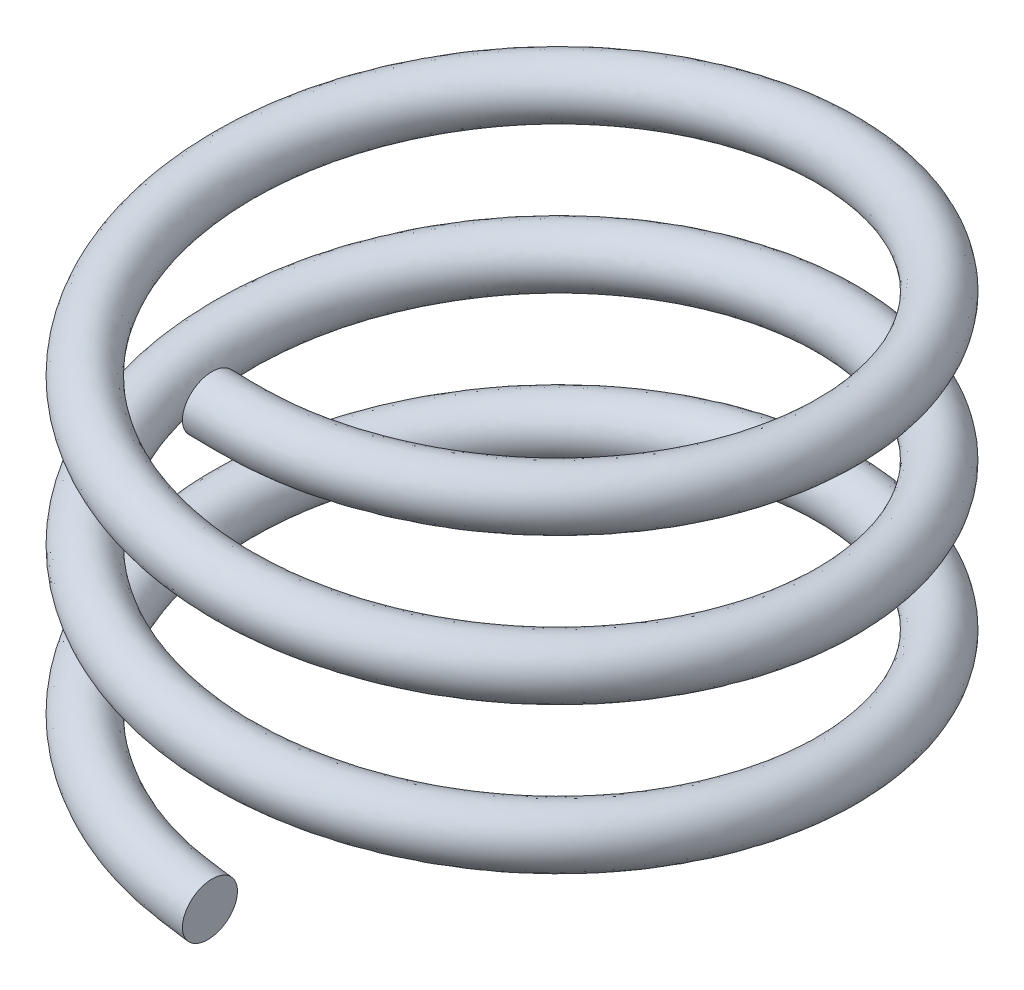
from build123d import *

# Parameters (mm, degrees)
BASE_SWEEP_PITCH  = 3.386666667
BASE_SWEEP_HEIGHT = 10.16
BASE_SWEEP_RADIUS = 6.985
SKETCH2_R         = 0.635


with BuildPart() as part:
    # Base-Sweep: sweep along a helix
    with BuildLine() as base_sweep_path:
        Helix(BASE_SWEEP_PITCH, BASE_SWEEP_HEIGHT, BASE_SWEEP_RADIUS, center=(0, 0, 0), direction=(0, 1, 0), lefthand=True)
    # Sketch2 → Base-Sweep (sweep)
    with BuildSketch(Plane(origin=(0, 0, 6.985), x_dir=(0, 0, 1), z_dir=(-0.9970359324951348, 0.07693730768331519, 0))):
        with Locations((0.000244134, -0.000631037)):
            Circle(SKETCH2_R)
    sweep(path=base_sweep_path.line, is_frenet=True)


solid = part.part
